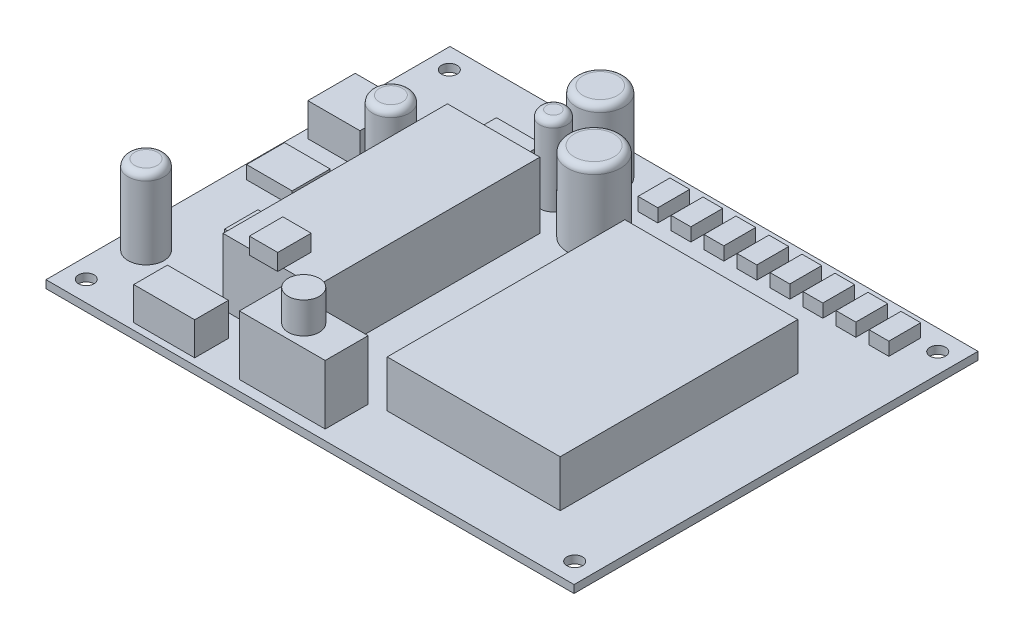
from build123d import *

# Parameters (mm, degrees)
SKETCH1_W           = 101.6
SKETCH1_H           = 77.724
SKETCH1_R           = 1.5
BOSS_EXTRUDE1_DEPTH = 1.5
SKETCH2_W           = 17.78
SKETCH2_H           = 43.18
BOSS_EXTRUDE2_DEPTH = 12.7
SKETCH3_W           = 16.51
SKETCH3_H           = 8.255
BOSS_EXTRUDE3_DEPTH = 11.43
SKETCH4_R           = 3
BOSS_EXTRUDE4_DEPTH = 6
SKETCH5_W           = 33.274
SKETCH5_H           = 45.72
BOSS_EXTRUDE5_DEPTH = 9
SKETCH6_R           = 4.570632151
SKETCH6_R_2         = 2.605395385
SKETCH6_R_3         = 5.079941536
SKETCH6_R_4         = 3.504212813
SKETCH6_R_5         = 3.453239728
BOSS_EXTRUDE6_DEPTH = 15.24
FILLET1_R           = 1.27
SKETCH7_W           = 3.798913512
SKETCH7_H           = 6.136706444
SKETCH7_W_2         = 8.766723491
SKETCH7_H_2         = 7.305602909
SKETCH7_W_3         = 7.159490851
SKETCH7_H_3         = 6.42893056
SKETCH7_W_4         = 8.912835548
SKETCH7_H_4         = 4.383361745
BOSS_EXTRUDE7_DEPTH = 2.54
SKETCH8_W           = 10.0349874
SKETCH8_H           = 9.108680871
SKETCH8_W_2         = 11.733216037
SKETCH8_H_2         = 6.484145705
BOSS_EXTRUDE8_DEPTH = 6.35
SKETCH9_W           = 5.45181725
SKETCH9_H           = 6.42893056
BOSS_EXTRUDE9_DEPTH = 3.175


with BuildPart() as part:
    # Sketch1 → Boss-Extrude1 (new body)
    with BuildSketch(Plane(origin=(0, 0, 0), x_dir=(1, 0, 0), z_dir=(0, 1, 0))):
        Rectangle(SKETCH1_W, SKETCH1_H)
        with Locations(Location((-46.99, 34.925, 0), (0, 0, 270))):
            Circle(SKETCH1_R, mode=Mode.SUBTRACT)
        with Locations(Location((46.99, 34.925, 0), (0, 0, 270))):
            Circle(SKETCH1_R, mode=Mode.SUBTRACT)
        with Locations(Location((46.99, -34.925, 0), (0, 0, 270))):
            Circle(SKETCH1_R, mode=Mode.SUBTRACT)
        with Locations(Location((-46.99, -34.925, 0), (0, 0, 270))):
            Circle(SKETCH1_R, mode=Mode.SUBTRACT)
    extrude(amount=BOSS_EXTRUDE1_DEPTH)

    # Sketch2 → Boss-Extrude2 (add)
    with BuildSketch(Plane(origin=(0, 1.5, 0), x_dir=(1, 0, 0), z_dir=(0, 1, 0))):
        with Locations((-19.894075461, -5.221562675)):
            Rectangle(SKETCH2_W, SKETCH2_H)
    extrude(amount=BOSS_EXTRUDE2_DEPTH)

    # Sketch3 → Boss-Extrude3 (add)
    with BuildSketch(Plane(origin=(0, 1.5, 0), x_dir=(1, 0, 0), z_dir=(0, 1, 0))):
        with Locations((-7.305934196, -32.765794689)):
            Rectangle(SKETCH3_W, SKETCH3_H)
    extrude(amount=BOSS_EXTRUDE3_DEPTH)

    # Sketch4 → Boss-Extrude4 (add)
    with BuildSketch(Plane(origin=(0, 12.93, 0), x_dir=(1, 0, 0), z_dir=(0, 1, 0))):
        with Locations(Location((-7.305934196, -32.765794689, 0), (0, 0, 270))):
            Circle(SKETCH4_R)
    extrude(amount=BOSS_EXTRUDE4_DEPTH)

    # Sketch5 → Boss-Extrude5 (add)
    with BuildSketch(Plane(origin=(0, 1.5, 0), x_dir=(1, 0, 0), z_dir=(0, 1, 0))):
        with Locations((20.528744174, -5.040866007)):
            Rectangle(SKETCH5_W, SKETCH5_H)
    extrude(amount=BOSS_EXTRUDE5_DEPTH)

    # Sketch6 → Boss-Extrude6 (add)
    with BuildSketch(Plane(origin=(0, 1.5, 0), x_dir=(1, 0, 0), z_dir=(0, 1, 0))):
        with Locations(Location((-14.584757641, 31.562504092, 0), (0, 0, 90))):
            Circle(SKETCH6_R)
        with Locations(Location((-15.105836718, 23.076359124, 0), (0, 0, 90))):
            Circle(SKETCH6_R_2)
        with Locations(Location((-5.205334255, 20.992042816, 0), (0, 0, 90))):
            Circle(SKETCH6_R_3)
        with Locations(Location((-33.120284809, 9.826062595, 0), (0, 0, 90))):
            Circle(SKETCH6_R_4)
        with Locations(Location((-46.072821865, -24.341836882, 0), (0, 0, 90))):
            Circle(SKETCH6_R_5)
    extrude(amount=BOSS_EXTRUDE6_DEPTH)

    # Fillet1
    fillet1_edges = [part.edges().sort_by_distance(p)[0] for p in [
        (-14.584757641, 16.74, -26.991871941),
        (-15.105836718, 16.74, -20.470963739),
        (-5.205334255, 16.74, -15.91210128),
        (-33.120284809, 16.74, -6.321849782),
        (-46.072821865, 16.74, 27.795076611),
    ]]
    fillet(fillet1_edges, radius=FILLET1_R)

    # Sketch7 → Boss-Extrude7 (add)
    with BuildSketch(Plane(origin=(0, 1.5, 0), x_dir=(1, 0, 0), z_dir=(0, 1, 0))):
        with Locations((3.062478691, 32.509932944)):
            Rectangle(SKETCH7_W, SKETCH7_H)
        with Locations((-43.760561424, 0.73056029)):
            Rectangle(SKETCH7_W_2, SKETCH7_H_2)
        with Locations((-35.943566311, -12.565637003)):
            Rectangle(SKETCH7_W_3, SKETCH7_H_3)
        with Locations((-27.469066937, 26.738506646)):
            Rectangle(SKETCH7_W_4, SKETCH7_H_4)
        with Locations((-3.287521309, 32.509932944)):
            Rectangle(SKETCH7_W, SKETCH7_H)
        with Locations((9.412478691, 32.509932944)):
            Rectangle(SKETCH7_W, SKETCH7_H)
        with Locations((15.762478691, 32.509932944)):
            Rectangle(SKETCH7_W, SKETCH7_H)
        with Locations((22.112478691, 32.509932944)):
            Rectangle(SKETCH7_W, SKETCH7_H)
        with Locations((28.462478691, 32.509932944)):
            Rectangle(SKETCH7_W, SKETCH7_H)
        with Locations((34.812478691, 32.509932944)):
            Rectangle(SKETCH7_W, SKETCH7_H)
        with Locations((41.162478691, 32.509932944)):
            Rectangle(SKETCH7_W, SKETCH7_H)
    extrude(amount=BOSS_EXTRUDE7_DEPTH)

    # Sketch8 → Boss-Extrude8 (add)
    with BuildSketch(Plane(origin=(0, 1.5, 0), x_dir=(1, 0, 0), z_dir=(0, 1, 0))):
        with Locations((-44.076752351, 14.367283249)):
            Rectangle(SKETCH8_W, SKETCH8_H)
        with Locations((-29.333040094, -34.341001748)):
            Rectangle(SKETCH8_W_2, SKETCH8_H_2)
    extrude(amount=BOSS_EXTRUDE8_DEPTH)

    # Sketch9 → Boss-Extrude9 (add)
    with BuildSketch(Plane(origin=(0, 14.2, 0), x_dir=(1, 0, 0), z_dir=(0, 1, 0))):
        with Locations((-19.894075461, -24.692937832)):
            Rectangle(SKETCH9_W, SKETCH9_H)
    extrude(amount=BOSS_EXTRUDE9_DEPTH)


solid = part.part
